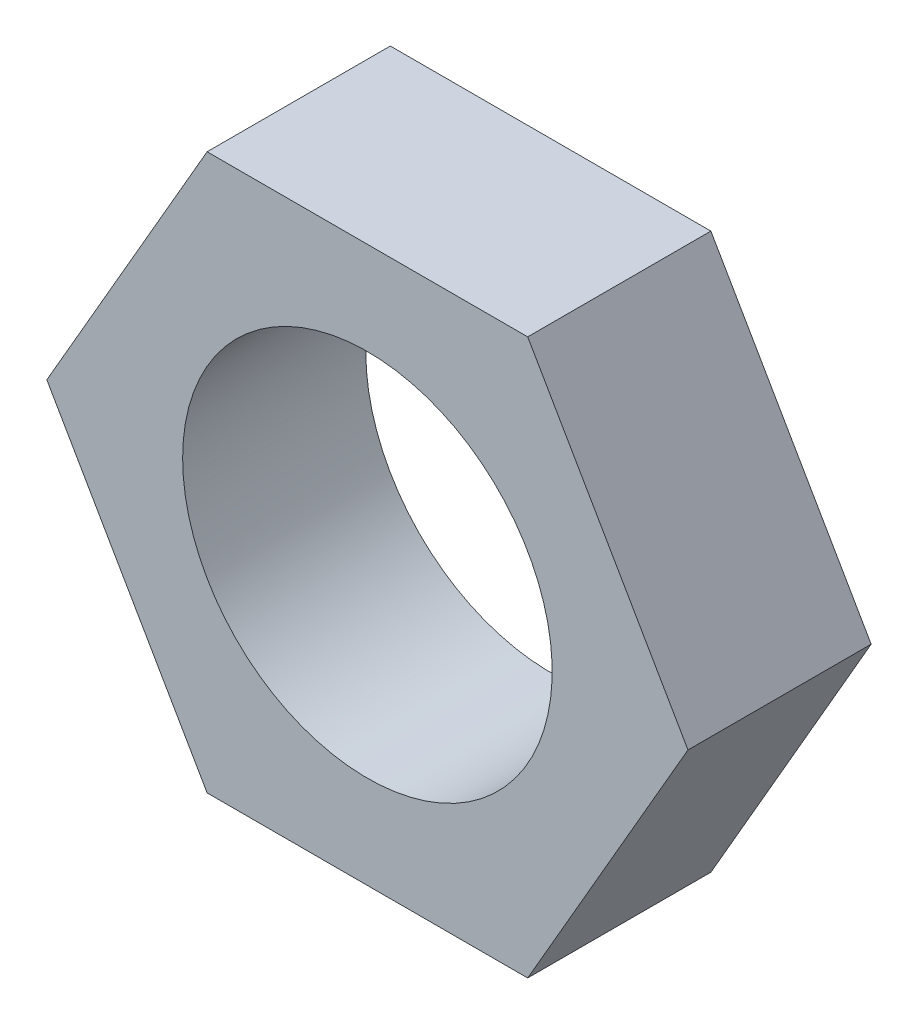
ISO-10303-21;
HEADER;
FILE_DESCRIPTION(('STEP AP214'),'2;1');
FILE_NAME('part.step','',(''),(''),'','','');
FILE_SCHEMA(('AUTOMOTIVE_DESIGN { 1 0 10303 214 1 1 1 1 }'));
ENDSEC;
DATA;
#1=APPLICATION_CONTEXT('core data for automotive mechanical design processes');
#2=APPLICATION_PROTOCOL_DEFINITION('international standard','automotive_design',2000,#1);
#3=PRODUCT_CONTEXT('',#1,'mechanical');
#4=PRODUCT('Part','Part','',(#3));
#5=PRODUCT_RELATED_PRODUCT_CATEGORY('part','',(#4));
#6=PRODUCT_DEFINITION_FORMATION('','',#4);
#7=PRODUCT_DEFINITION_CONTEXT('part definition',#1,'design');
#8=PRODUCT_DEFINITION('design','',#6,#7);
#9=PRODUCT_DEFINITION_SHAPE('','',#8);
#10=(LENGTH_UNIT() NAMED_UNIT(*) SI_UNIT(.MILLI.,.METRE.));
#11=(NAMED_UNIT(*) PLANE_ANGLE_UNIT() SI_UNIT($,.RADIAN.));
#12=(NAMED_UNIT(*) SI_UNIT($,.STERADIAN.) SOLID_ANGLE_UNIT());
#13=UNCERTAINTY_MEASURE_WITH_UNIT(LENGTH_MEASURE(1.E-05),#10,'distance_accuracy_value','');
#14=(GEOMETRIC_REPRESENTATION_CONTEXT(3) GLOBAL_UNCERTAINTY_ASSIGNED_CONTEXT((#13)) GLOBAL_UNIT_ASSIGNED_CONTEXT((#10,
#11,#12)) REPRESENTATION_CONTEXT('',''));
#15=CARTESIAN_POINT('',(0.,0.,0.));
#16=DIRECTION('',(0.,0.,1.));
#17=DIRECTION('',(1.,0.,0.));
#18=AXIS2_PLACEMENT_3D('',#15,#16,#17);
#19=CARTESIAN_POINT('',(-11.1125,-19.2474145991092,0.));
#20=DIRECTION('',(0.,-1.,0.));
#21=DIRECTION('',(0.,0.,-1.));
#22=AXIS2_PLACEMENT_3D('',#19,#20,#21);
#23=PLANE('',#22);
#24=DIRECTION('',(1.,0.,0.));
#25=VECTOR('',#24,1.);
#26=CARTESIAN_POINT('',(-11.1125,-19.2474145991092,12.7));
#27=LINE('',#26,#25);
#28=CARTESIAN_POINT('',(-11.1125,-19.2474145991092,12.7));
#29=VERTEX_POINT('',#28);
#30=CARTESIAN_POINT('',(11.1125,-19.2474145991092,12.7));
#31=VERTEX_POINT('',#30);
#32=EDGE_CURVE('E116',#29,#31,#27,.T.);
#33=ORIENTED_EDGE('',*,*,#32,.F.);
#34=DIRECTION('',(0.,0.,1.));
#35=VECTOR('',#34,1.);
#36=CARTESIAN_POINT('',(-11.1125,-19.2474145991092,0.));
#37=LINE('',#36,#35);
#38=CARTESIAN_POINT('',(-11.1125,-19.2474145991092,0.));
#39=VERTEX_POINT('',#38);
#40=EDGE_CURVE('E11',#39,#29,#37,.T.);
#41=ORIENTED_EDGE('',*,*,#40,.F.);
#42=DIRECTION('',(1.,0.,0.));
#43=VECTOR('',#42,1.);
#44=CARTESIAN_POINT('',(-11.1125,-19.2474145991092,0.));
#45=LINE('',#44,#43);
#46=CARTESIAN_POINT('',(11.1125,-19.2474145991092,0.));
#47=VERTEX_POINT('',#46);
#48=EDGE_CURVE('E131',#39,#47,#45,.T.);
#49=ORIENTED_EDGE('',*,*,#48,.T.);
#50=DIRECTION('',(0.,0.,1.));
#51=VECTOR('',#50,1.);
#52=CARTESIAN_POINT('',(11.1125,-19.2474145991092,0.));
#53=LINE('',#52,#51);
#54=EDGE_CURVE('E34',#47,#31,#53,.T.);
#55=ORIENTED_EDGE('',*,*,#54,.T.);
#56=EDGE_LOOP('',(#33,#41,#49,#55));
#57=FACE_BOUND('',#56,.T.);
#58=ADVANCED_FACE('F31',(#57),#23,.T.);
#59=CARTESIAN_POINT('',(-22.225,0.,0.));
#60=DIRECTION('',(-0.866025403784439,-0.5,0.));
#61=DIRECTION('',(0.5,-0.866025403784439,0.));
#62=AXIS2_PLACEMENT_3D('',#59,#60,#61);
#63=PLANE('',#62);
#64=DIRECTION('',(0.5,-0.866025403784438,0.));
#65=VECTOR('',#64,1.);
#66=CARTESIAN_POINT('',(-22.225,0.,12.7));
#67=LINE('',#66,#65);
#68=CARTESIAN_POINT('',(-22.225,0.,12.7));
#69=VERTEX_POINT('',#68);
#70=EDGE_CURVE('E129',#69,#29,#67,.T.);
#71=ORIENTED_EDGE('',*,*,#70,.F.);
#72=DIRECTION('',(0.,0.,1.));
#73=VECTOR('',#72,1.);
#74=CARTESIAN_POINT('',(-22.225,0.,0.));
#75=LINE('',#74,#73);
#76=CARTESIAN_POINT('',(-22.225,0.,0.));
#77=VERTEX_POINT('',#76);
#78=EDGE_CURVE('E40',#77,#69,#75,.T.);
#79=ORIENTED_EDGE('',*,*,#78,.F.);
#80=DIRECTION('',(0.5,-0.866025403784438,0.));
#81=VECTOR('',#80,1.);
#82=CARTESIAN_POINT('',(-22.225,0.,0.));
#83=LINE('',#82,#81);
#84=EDGE_CURVE('E106',#77,#39,#83,.T.);
#85=ORIENTED_EDGE('',*,*,#84,.T.);
#86=ORIENTED_EDGE('',*,*,#40,.T.);
#87=EDGE_LOOP('',(#71,#79,#85,#86));
#88=FACE_BOUND('',#87,.T.);
#89=ADVANCED_FACE('F139',(#88),#63,.T.);
#90=CARTESIAN_POINT('',(-11.1125,19.2474145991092,0.));
#91=DIRECTION('',(-0.866025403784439,0.5,0.));
#92=DIRECTION('',(-0.5,-0.866025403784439,0.));
#93=AXIS2_PLACEMENT_3D('',#90,#91,#92);
#94=PLANE('',#93);
#95=DIRECTION('',(-0.5,-0.866025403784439,0.));
#96=VECTOR('',#95,1.);
#97=CARTESIAN_POINT('',(-11.1125,19.2474145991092,12.7));
#98=LINE('',#97,#96);
#99=CARTESIAN_POINT('',(-11.1125,19.2474145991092,12.7));
#100=VERTEX_POINT('',#99);
#101=EDGE_CURVE('E93',#100,#69,#98,.T.);
#102=ORIENTED_EDGE('',*,*,#101,.F.);
#103=DIRECTION('',(0.,0.,1.));
#104=VECTOR('',#103,1.);
#105=CARTESIAN_POINT('',(-11.1125,19.2474145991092,0.));
#106=LINE('',#105,#104);
#107=CARTESIAN_POINT('',(-11.1125,19.2474145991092,0.));
#108=VERTEX_POINT('',#107);
#109=EDGE_CURVE('E88',#108,#100,#106,.T.);
#110=ORIENTED_EDGE('',*,*,#109,.F.);
#111=DIRECTION('',(-0.5,-0.866025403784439,0.));
#112=VECTOR('',#111,1.);
#113=CARTESIAN_POINT('',(-11.1125,19.2474145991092,0.));
#114=LINE('',#113,#112);
#115=EDGE_CURVE('E91',#108,#77,#114,.T.);
#116=ORIENTED_EDGE('',*,*,#115,.T.);
#117=ORIENTED_EDGE('',*,*,#78,.T.);
#118=EDGE_LOOP('',(#102,#110,#116,#117));
#119=FACE_BOUND('',#118,.T.);
#120=ADVANCED_FACE('F90',(#119),#94,.T.);
#121=CARTESIAN_POINT('',(11.1125,19.2474145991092,0.));
#122=DIRECTION('',(0.,1.,0.));
#123=DIRECTION('',(0.,0.,1.));
#124=AXIS2_PLACEMENT_3D('',#121,#122,#123);
#125=PLANE('',#124);
#126=DIRECTION('',(-1.,0.,0.));
#127=VECTOR('',#126,1.);
#128=CARTESIAN_POINT('',(11.1125,19.2474145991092,12.7));
#129=LINE('',#128,#127);
#130=CARTESIAN_POINT('',(11.1125,19.2474145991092,12.7));
#131=VERTEX_POINT('',#130);
#132=EDGE_CURVE('E126',#131,#100,#129,.T.);
#133=ORIENTED_EDGE('',*,*,#132,.F.);
#134=DIRECTION('',(0.,0.,1.));
#135=VECTOR('',#134,1.);
#136=CARTESIAN_POINT('',(11.1125,19.2474145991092,0.));
#137=LINE('',#136,#135);
#138=CARTESIAN_POINT('',(11.1125,19.2474145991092,0.));
#139=VERTEX_POINT('',#138);
#140=EDGE_CURVE('E98',#139,#131,#137,.T.);
#141=ORIENTED_EDGE('',*,*,#140,.F.);
#142=DIRECTION('',(-1.,0.,0.));
#143=VECTOR('',#142,1.);
#144=CARTESIAN_POINT('',(11.1125,19.2474145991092,0.));
#145=LINE('',#144,#143);
#146=EDGE_CURVE('E104',#139,#108,#145,.T.);
#147=ORIENTED_EDGE('',*,*,#146,.T.);
#148=ORIENTED_EDGE('',*,*,#109,.T.);
#149=EDGE_LOOP('',(#133,#141,#147,#148));
#150=FACE_BOUND('',#149,.T.);
#151=ADVANCED_FACE('F108',(#150),#125,.T.);
#152=CARTESIAN_POINT('',(22.225,0.,0.));
#153=DIRECTION('',(0.866025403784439,0.5,0.));
#154=DIRECTION('',(-0.5,0.866025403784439,0.));
#155=AXIS2_PLACEMENT_3D('',#152,#153,#154);
#156=PLANE('',#155);
#157=DIRECTION('',(-0.5,0.866025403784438,0.));
#158=VECTOR('',#157,1.);
#159=CARTESIAN_POINT('',(22.225,0.,12.7));
#160=LINE('',#159,#158);
#161=CARTESIAN_POINT('',(22.225,0.,12.7));
#162=VERTEX_POINT('',#161);
#163=EDGE_CURVE('E123',#162,#131,#160,.T.);
#164=ORIENTED_EDGE('',*,*,#163,.F.);
#165=DIRECTION('',(0.,0.,1.));
#166=VECTOR('',#165,1.);
#167=CARTESIAN_POINT('',(22.225,0.,0.));
#168=LINE('',#167,#166);
#169=CARTESIAN_POINT('',(22.225,0.,0.));
#170=VERTEX_POINT('',#169);
#171=EDGE_CURVE('E134',#170,#162,#168,.T.);
#172=ORIENTED_EDGE('',*,*,#171,.F.);
#173=DIRECTION('',(-0.5,0.866025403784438,0.));
#174=VECTOR('',#173,1.);
#175=CARTESIAN_POINT('',(22.225,0.,0.));
#176=LINE('',#175,#174);
#177=EDGE_CURVE('E109',#170,#139,#176,.T.);
#178=ORIENTED_EDGE('',*,*,#177,.T.);
#179=ORIENTED_EDGE('',*,*,#140,.T.);
#180=EDGE_LOOP('',(#164,#172,#178,#179));
#181=FACE_BOUND('',#180,.T.);
#182=ADVANCED_FACE('F152',(#181),#156,.T.);
#183=CARTESIAN_POINT('',(11.1125,-19.2474145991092,0.));
#184=DIRECTION('',(0.866025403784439,-0.5,0.));
#185=DIRECTION('',(0.5,0.866025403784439,0.));
#186=AXIS2_PLACEMENT_3D('',#183,#184,#185);
#187=PLANE('',#186);
#188=DIRECTION('',(0.5,0.866025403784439,0.));
#189=VECTOR('',#188,1.);
#190=CARTESIAN_POINT('',(11.1125,-19.2474145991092,12.7));
#191=LINE('',#190,#189);
#192=EDGE_CURVE('E119',#31,#162,#191,.T.);
#193=ORIENTED_EDGE('',*,*,#192,.F.);
#194=ORIENTED_EDGE('',*,*,#54,.F.);
#195=DIRECTION('',(0.5,0.866025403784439,0.));
#196=VECTOR('',#195,1.);
#197=CARTESIAN_POINT('',(11.1125,-19.2474145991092,0.));
#198=LINE('',#197,#196);
#199=EDGE_CURVE('E111',#47,#170,#198,.T.);
#200=ORIENTED_EDGE('',*,*,#199,.T.);
#201=ORIENTED_EDGE('',*,*,#171,.T.);
#202=EDGE_LOOP('',(#193,#194,#200,#201));
#203=FACE_BOUND('',#202,.T.);
#204=ADVANCED_FACE('F136',(#203),#187,.T.);
#205=CARTESIAN_POINT('',(11.1125,-19.2474145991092,0.));
#206=DIRECTION('',(0.,0.,1.));
#207=DIRECTION('',(1.,0.,0.));
#208=AXIS2_PLACEMENT_3D('',#205,#206,#207);
#209=PLANE('',#208);
#210=CARTESIAN_POINT('',(0.,0.,0.));
#211=DIRECTION('',(0.,0.,1.));
#212=DIRECTION('',(-1.,0.,0.));
#213=AXIS2_PLACEMENT_3D('',#210,#211,#212);
#214=CIRCLE('',#213,12.8107312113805);
#215=CARTESIAN_POINT('',(-12.8107312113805,0.,0.));
#216=VERTEX_POINT('',#215);
#217=EDGE_CURVE('E120',#216,#216,#214,.T.);
#218=ORIENTED_EDGE('',*,*,#217,.T.);
#219=EDGE_LOOP('',(#218));
#220=FACE_BOUND('',#219,.T.);
#221=ORIENTED_EDGE('',*,*,#48,.F.);
#222=ORIENTED_EDGE('',*,*,#84,.F.);
#223=ORIENTED_EDGE('',*,*,#115,.F.);
#224=ORIENTED_EDGE('',*,*,#146,.F.);
#225=ORIENTED_EDGE('',*,*,#177,.F.);
#226=ORIENTED_EDGE('',*,*,#199,.F.);
#227=EDGE_LOOP('',(#221,#222,#223,#224,#225,#226));
#228=FACE_BOUND('',#227,.T.);
#229=ADVANCED_FACE('F102',(#220,#228),#209,.F.);
#230=CARTESIAN_POINT('',(11.1125,-19.2474145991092,12.7));
#231=DIRECTION('',(0.,0.,1.));
#232=DIRECTION('',(1.,0.,0.));
#233=AXIS2_PLACEMENT_3D('',#230,#231,#232);
#234=PLANE('',#233);
#235=CARTESIAN_POINT('',(0.,0.,12.7));
#236=DIRECTION('',(0.,0.,1.));
#237=DIRECTION('',(-1.,0.,0.));
#238=AXIS2_PLACEMENT_3D('',#235,#236,#237);
#239=CIRCLE('',#238,12.8107312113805);
#240=CARTESIAN_POINT('',(-12.8107312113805,0.,12.7));
#241=VERTEX_POINT('',#240);
#242=EDGE_CURVE('E175',#241,#241,#239,.T.);
#243=ORIENTED_EDGE('',*,*,#242,.F.);
#244=EDGE_LOOP('',(#243));
#245=FACE_BOUND('',#244,.T.);
#246=ORIENTED_EDGE('',*,*,#32,.T.);
#247=ORIENTED_EDGE('',*,*,#192,.T.);
#248=ORIENTED_EDGE('',*,*,#163,.T.);
#249=ORIENTED_EDGE('',*,*,#132,.T.);
#250=ORIENTED_EDGE('',*,*,#101,.T.);
#251=ORIENTED_EDGE('',*,*,#70,.T.);
#252=EDGE_LOOP('',(#246,#247,#248,#249,#250,#251));
#253=FACE_BOUND('',#252,.T.);
#254=ADVANCED_FACE('F138',(#245,#253),#234,.T.);
#255=CARTESIAN_POINT('',(0.,0.,0.));
#256=DIRECTION('',(0.,0.,1.));
#257=DIRECTION('',(1.,0.,0.));
#258=AXIS2_PLACEMENT_3D('',#255,#256,#257);
#259=CYLINDRICAL_SURFACE('',#258,12.8107312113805);
#260=ORIENTED_EDGE('',*,*,#217,.F.);
#261=EDGE_LOOP('',(#260));
#262=FACE_BOUND('',#261,.T.);
#263=ORIENTED_EDGE('',*,*,#242,.T.);
#264=EDGE_LOOP('',(#263));
#265=FACE_BOUND('',#264,.T.);
#266=ADVANCED_FACE('F163',(#262,#265),#259,.F.);
#267=CLOSED_SHELL('',(#58,#89,#120,#151,#182,#204,#229,#254,#266));
#268=MANIFOLD_SOLID_BREP('B2',#267);
#269=ADVANCED_BREP_SHAPE_REPRESENTATION('',(#18,#268),#14);
#270=SHAPE_DEFINITION_REPRESENTATION(#9,#269);
ENDSEC;
END-ISO-10303-21;
